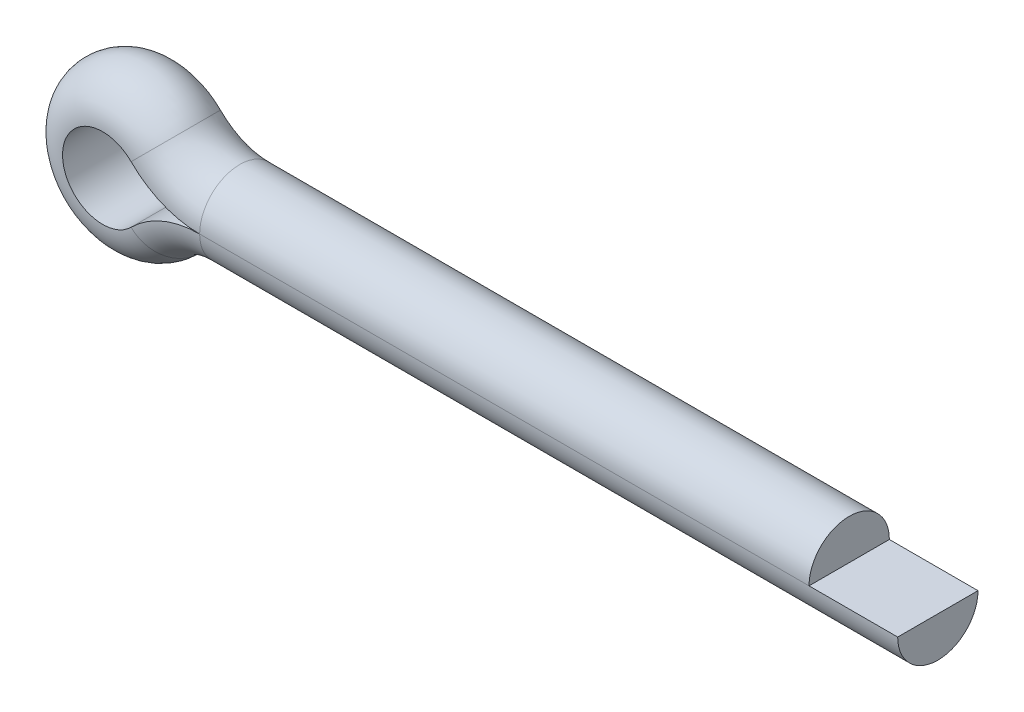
ISO-10303-21;
HEADER;
FILE_DESCRIPTION(('STEP AP214'),'2;1');
FILE_NAME('part.step','',(''),(''),'','','');
FILE_SCHEMA(('AUTOMOTIVE_DESIGN { 1 0 10303 214 1 1 1 1 }'));
ENDSEC;
DATA;
#1=APPLICATION_CONTEXT('core data for automotive mechanical design processes');
#2=APPLICATION_PROTOCOL_DEFINITION('international standard','automotive_design',2000,#1);
#3=PRODUCT_CONTEXT('',#1,'mechanical');
#4=PRODUCT('Part','Part','',(#3));
#5=PRODUCT_RELATED_PRODUCT_CATEGORY('part','',(#4));
#6=PRODUCT_DEFINITION_FORMATION('','',#4);
#7=PRODUCT_DEFINITION_CONTEXT('part definition',#1,'design');
#8=PRODUCT_DEFINITION('design','',#6,#7);
#9=PRODUCT_DEFINITION_SHAPE('','',#8);
#10=(LENGTH_UNIT() NAMED_UNIT(*) SI_UNIT(.MILLI.,.METRE.));
#11=(NAMED_UNIT(*) PLANE_ANGLE_UNIT() SI_UNIT($,.RADIAN.));
#12=(NAMED_UNIT(*) SI_UNIT($,.STERADIAN.) SOLID_ANGLE_UNIT());
#13=UNCERTAINTY_MEASURE_WITH_UNIT(LENGTH_MEASURE(1.E-05),#10,'distance_accuracy_value','');
#14=(GEOMETRIC_REPRESENTATION_CONTEXT(3) GLOBAL_UNCERTAINTY_ASSIGNED_CONTEXT((#13)) GLOBAL_UNIT_ASSIGNED_CONTEXT((#10,
#11,#12)) REPRESENTATION_CONTEXT('',''));
#15=CARTESIAN_POINT('',(0.,0.,0.));
#16=DIRECTION('',(0.,0.,1.));
#17=DIRECTION('',(1.,0.,0.));
#18=AXIS2_PLACEMENT_3D('',#15,#16,#17);
#19=CARTESIAN_POINT('',(6.40000000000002,0.,-1.45));
#20=DIRECTION('',(0.,-1.,0.));
#21=DIRECTION('',(1.,0.,0.));
#22=AXIS2_PLACEMENT_3D('',#19,#20,#21);
#23=PLANE('',#22);
#24=DIRECTION('',(0.,0.,-1.));
#25=VECTOR('',#24,1.);
#26=CARTESIAN_POINT('',(6.40000000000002,0.,-1.45));
#27=LINE('',#26,#25);
#28=CARTESIAN_POINT('',(6.40000000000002,0.,1.45));
#29=VERTEX_POINT('',#28);
#30=CARTESIAN_POINT('',(6.40000000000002,0.,-1.45));
#31=VERTEX_POINT('',#30);
#32=EDGE_CURVE('E137',#29,#31,#27,.T.);
#33=ORIENTED_EDGE('',*,*,#32,.F.);
#34=DIRECTION('',(1.,0.,0.));
#35=VECTOR('',#34,1.);
#36=CARTESIAN_POINT('',(6.40000000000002,0.,1.45));
#37=LINE('',#36,#35);
#38=CARTESIAN_POINT('',(31.6,0.,1.45));
#39=VERTEX_POINT('',#38);
#40=EDGE_CURVE('E37',#29,#39,#37,.T.);
#41=ORIENTED_EDGE('',*,*,#40,.T.);
#42=DIRECTION('',(0.,0.,-1.));
#43=VECTOR('',#42,1.);
#44=CARTESIAN_POINT('',(31.6,0.,-1.45));
#45=LINE('',#44,#43);
#46=CARTESIAN_POINT('',(31.6,0.,-1.45));
#47=VERTEX_POINT('',#46);
#48=EDGE_CURVE('E44',#39,#47,#45,.T.);
#49=ORIENTED_EDGE('',*,*,#48,.T.);
#50=DIRECTION('',(1.,0.,0.));
#51=VECTOR('',#50,1.);
#52=CARTESIAN_POINT('',(6.40000000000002,0.,-1.45));
#53=LINE('',#52,#51);
#54=EDGE_CURVE('E11',#31,#47,#53,.T.);
#55=ORIENTED_EDGE('',*,*,#54,.F.);
#56=EDGE_LOOP('',(#33,#41,#49,#55));
#57=FACE_BOUND('',#56,.T.);
#58=ADVANCED_FACE('F30',(#57),#23,.F.);
#59=CARTESIAN_POINT('',(6.40000000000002,0.,0.));
#60=DIRECTION('',(1.,0.,0.));
#61=DIRECTION('',(0.,1.,0.));
#62=AXIS2_PLACEMENT_3D('',#59,#60,#61);
#63=CYLINDRICAL_SURFACE('',#62,1.45);
#64=CARTESIAN_POINT('',(6.40000000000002,0.,0.));
#65=DIRECTION('',(-1.,0.,0.));
#66=DIRECTION('',(0.,0.,-1.));
#67=AXIS2_PLACEMENT_3D('',#64,#65,#66);
#68=CIRCLE('',#67,1.45);
#69=EDGE_CURVE('E134',#31,#29,#68,.T.);
#70=ORIENTED_EDGE('',*,*,#69,.F.);
#71=ORIENTED_EDGE('',*,*,#54,.T.);
#72=CARTESIAN_POINT('',(31.6,0.,0.));
#73=DIRECTION('',(-1.,0.,0.));
#74=DIRECTION('',(0.,0.,-1.));
#75=AXIS2_PLACEMENT_3D('',#72,#73,#74);
#76=CIRCLE('',#75,1.45);
#77=EDGE_CURVE('E50',#47,#39,#76,.T.);
#78=ORIENTED_EDGE('',*,*,#77,.T.);
#79=ORIENTED_EDGE('',*,*,#40,.F.);
#80=EDGE_LOOP('',(#70,#71,#78,#79));
#81=FACE_BOUND('',#80,.T.);
#82=ADVANCED_FACE('F149',(#81),#63,.T.);
#83=CARTESIAN_POINT('',(6.4,-3.49913793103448,0.));
#84=DIRECTION('',(0.,0.,-1.));
#85=DIRECTION('',(-1.,0.,0.));
#86=AXIS2_PLACEMENT_3D('',#83,#84,#85);
#87=CYLINDRICAL_SURFACE('',#86,3.49913793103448);
#88=DIRECTION('',(0.,0.,-1.));
#89=VECTOR('',#88,1.);
#90=CARTESIAN_POINT('',(3.92543110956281,-1.02517854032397,-1.45));
#91=LINE('',#90,#89);
#92=CARTESIAN_POINT('',(3.92543110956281,-1.02517854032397,1.45));
#93=VERTEX_POINT('',#92);
#94=CARTESIAN_POINT('',(3.92543110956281,-1.02517854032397,-1.45));
#95=VERTEX_POINT('',#94);
#96=EDGE_CURVE('E125',#93,#95,#91,.T.);
#97=ORIENTED_EDGE('',*,*,#96,.F.);
#98=CARTESIAN_POINT('',(6.4,-3.49913793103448,1.45));
#99=DIRECTION('',(0.,0.,-1.));
#100=DIRECTION('',(-1.,0.,0.));
#101=AXIS2_PLACEMENT_3D('',#98,#99,#100);
#102=CIRCLE('',#101,3.49913793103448);
#103=EDGE_CURVE('E140',#93,#29,#102,.T.);
#104=ORIENTED_EDGE('',*,*,#103,.T.);
#105=ORIENTED_EDGE('',*,*,#32,.T.);
#106=CARTESIAN_POINT('',(6.4,-3.49913793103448,-1.45));
#107=DIRECTION('',(0.,0.,-1.));
#108=DIRECTION('',(-1.,0.,0.));
#109=AXIS2_PLACEMENT_3D('',#106,#107,#108);
#110=CIRCLE('',#109,3.49913793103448);
#111=EDGE_CURVE('E143',#95,#31,#110,.T.);
#112=ORIENTED_EDGE('',*,*,#111,.F.);
#113=EDGE_LOOP('',(#97,#104,#105,#112));
#114=FACE_BOUND('',#113,.T.);
#115=ADVANCED_FACE('F153',(#114),#87,.T.);
#116=CARTESIAN_POINT('',(6.4,-3.49913793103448,0.));
#117=DIRECTION('',(0.,0.,-1.));
#118=DIRECTION('',(-1.,0.,0.));
#119=AXIS2_PLACEMENT_3D('',#116,#117,#118);
#120=TOROIDAL_SURFACE('',#119,3.49913793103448,1.45);
#121=CARTESIAN_POINT('',(3.92543110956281,-1.02517854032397,0.));
#122=DIRECTION('',(-0.707019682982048,-0.707193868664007,0.));
#123=DIRECTION('',(0.,0.,-1.));
#124=AXIS2_PLACEMENT_3D('',#121,#122,#123);
#125=CIRCLE('',#124,1.45);
#126=EDGE_CURVE('E122',#95,#93,#125,.T.);
#127=ORIENTED_EDGE('',*,*,#126,.F.);
#128=ORIENTED_EDGE('',*,*,#111,.T.);
#129=ORIENTED_EDGE('',*,*,#69,.T.);
#130=ORIENTED_EDGE('',*,*,#103,.F.);
#131=EDGE_LOOP('',(#127,#128,#129,#130));
#132=FACE_BOUND('',#131,.T.);
#133=ADVANCED_FACE('F155',(#132),#120,.T.);
#134=CARTESIAN_POINT('',(2.9,0.,0.));
#135=DIRECTION('',(0.,0.,1.));
#136=DIRECTION('',(1.,0.,0.));
#137=AXIS2_PLACEMENT_3D('',#134,#135,#136);
#138=CYLINDRICAL_SURFACE('',#137,1.45);
#139=DIRECTION('',(0.,0.,-1.));
#140=VECTOR('',#139,1.);
#141=CARTESIAN_POINT('',(3.9254311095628,1.02517854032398,-1.45));
#142=LINE('',#141,#140);
#143=CARTESIAN_POINT('',(3.9254311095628,1.02517854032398,1.45));
#144=VERTEX_POINT('',#143);
#145=CARTESIAN_POINT('',(3.9254311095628,1.02517854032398,-1.45));
#146=VERTEX_POINT('',#145);
#147=EDGE_CURVE('E94',#144,#146,#142,.T.);
#148=ORIENTED_EDGE('',*,*,#147,.F.);
#149=CARTESIAN_POINT('',(2.9,0.,1.45));
#150=DIRECTION('',(0.,0.,1.));
#151=DIRECTION('',(1.,0.,0.));
#152=AXIS2_PLACEMENT_3D('',#149,#150,#151);
#153=CIRCLE('',#152,1.45);
#154=EDGE_CURVE('E128',#144,#93,#153,.T.);
#155=ORIENTED_EDGE('',*,*,#154,.T.);
#156=ORIENTED_EDGE('',*,*,#96,.T.);
#157=CARTESIAN_POINT('',(2.9,0.,-1.45));
#158=DIRECTION('',(0.,0.,1.));
#159=DIRECTION('',(1.,0.,0.));
#160=AXIS2_PLACEMENT_3D('',#157,#158,#159);
#161=CIRCLE('',#160,1.45);
#162=EDGE_CURVE('E131',#146,#95,#161,.T.);
#163=ORIENTED_EDGE('',*,*,#162,.F.);
#164=EDGE_LOOP('',(#148,#155,#156,#163));
#165=FACE_BOUND('',#164,.T.);
#166=ADVANCED_FACE('F159',(#165),#138,.F.);
#167=CARTESIAN_POINT('',(2.9,0.,0.));
#168=DIRECTION('',(0.,0.,1.));
#169=DIRECTION('',(1.,0.,0.));
#170=AXIS2_PLACEMENT_3D('',#167,#168,#169);
#171=TOROIDAL_SURFACE('',#170,1.45,1.45);
#172=CARTESIAN_POINT('',(3.9254311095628,1.02517854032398,0.));
#173=DIRECTION('',(0.70701968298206,-0.707193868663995,0.));
#174=DIRECTION('',(0.,0.,-1.));
#175=AXIS2_PLACEMENT_3D('',#172,#173,#174);
#176=CIRCLE('',#175,1.45);
#177=EDGE_CURVE('E90',#146,#144,#176,.T.);
#178=ORIENTED_EDGE('',*,*,#177,.F.);
#179=ORIENTED_EDGE('',*,*,#162,.T.);
#180=ORIENTED_EDGE('',*,*,#126,.T.);
#181=ORIENTED_EDGE('',*,*,#154,.F.);
#182=EDGE_LOOP('',(#178,#179,#180,#181));
#183=FACE_BOUND('',#182,.T.);
#184=ADVANCED_FACE('F160',(#183),#171,.T.);
#185=CARTESIAN_POINT('',(6.4,3.49913793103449,0.));
#186=DIRECTION('',(0.,0.,-1.));
#187=DIRECTION('',(-1.,0.,0.));
#188=AXIS2_PLACEMENT_3D('',#185,#186,#187);
#189=CYLINDRICAL_SURFACE('',#188,3.49913793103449);
#190=DIRECTION('',(0.,0.,-1.));
#191=VECTOR('',#190,1.);
#192=CARTESIAN_POINT('',(6.4,0.,-1.45));
#193=LINE('',#192,#191);
#194=CARTESIAN_POINT('',(6.4,0.,1.45));
#195=VERTEX_POINT('',#194);
#196=CARTESIAN_POINT('',(6.4,0.,-1.45));
#197=VERTEX_POINT('',#196);
#198=EDGE_CURVE('E97',#195,#197,#193,.T.);
#199=ORIENTED_EDGE('',*,*,#198,.F.);
#200=CARTESIAN_POINT('',(6.4,3.49913793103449,1.45));
#201=DIRECTION('',(0.,0.,-1.));
#202=DIRECTION('',(-1.,0.,0.));
#203=AXIS2_PLACEMENT_3D('',#200,#201,#202);
#204=CIRCLE('',#203,3.49913793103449);
#205=EDGE_CURVE('E82',#195,#144,#204,.T.);
#206=ORIENTED_EDGE('',*,*,#205,.T.);
#207=ORIENTED_EDGE('',*,*,#147,.T.);
#208=CARTESIAN_POINT('',(6.4,3.49913793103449,-1.45));
#209=DIRECTION('',(0.,0.,-1.));
#210=DIRECTION('',(-1.,0.,0.));
#211=AXIS2_PLACEMENT_3D('',#208,#209,#210);
#212=CIRCLE('',#211,3.49913793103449);
#213=EDGE_CURVE('E93',#197,#146,#212,.T.);
#214=ORIENTED_EDGE('',*,*,#213,.F.);
#215=EDGE_LOOP('',(#199,#206,#207,#214));
#216=FACE_BOUND('',#215,.T.);
#217=ADVANCED_FACE('F99',(#216),#189,.T.);
#218=CARTESIAN_POINT('',(6.4,3.49913793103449,0.));
#219=DIRECTION('',(0.,0.,-1.));
#220=DIRECTION('',(-1.,0.,0.));
#221=AXIS2_PLACEMENT_3D('',#218,#219,#220);
#222=TOROIDAL_SURFACE('',#221,3.49913793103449,1.45);
#223=CARTESIAN_POINT('',(6.4,0.,0.));
#224=DIRECTION('',(1.,0.,0.));
#225=DIRECTION('',(0.,0.,-1.));
#226=AXIS2_PLACEMENT_3D('',#223,#224,#225);
#227=CIRCLE('',#226,1.45);
#228=EDGE_CURVE('E87',#197,#195,#227,.T.);
#229=ORIENTED_EDGE('',*,*,#228,.F.);
#230=ORIENTED_EDGE('',*,*,#213,.T.);
#231=ORIENTED_EDGE('',*,*,#177,.T.);
#232=ORIENTED_EDGE('',*,*,#205,.F.);
#233=EDGE_LOOP('',(#229,#230,#231,#232));
#234=FACE_BOUND('',#233,.T.);
#235=ADVANCED_FACE('F84',(#234),#222,.T.);
#236=CARTESIAN_POINT('',(6.4,0.,0.));
#237=DIRECTION('',(1.,0.,0.));
#238=DIRECTION('',(0.,0.,-1.));
#239=AXIS2_PLACEMENT_3D('',#236,#237,#238);
#240=CYLINDRICAL_SURFACE('',#239,1.45);
#241=CARTESIAN_POINT('',(28.4,0.,0.));
#242=DIRECTION('',(1.,0.,0.));
#243=DIRECTION('',(0.,0.,-1.));
#244=AXIS2_PLACEMENT_3D('',#241,#242,#243);
#245=CIRCLE('',#244,1.45);
#246=CARTESIAN_POINT('',(28.4,0.,-1.45));
#247=VERTEX_POINT('',#246);
#248=CARTESIAN_POINT('',(28.4,0.,1.45));
#249=VERTEX_POINT('',#248);
#250=EDGE_CURVE('E114',#247,#249,#245,.T.);
#251=ORIENTED_EDGE('',*,*,#250,.F.);
#252=DIRECTION('',(1.,0.,0.));
#253=VECTOR('',#252,1.);
#254=CARTESIAN_POINT('',(6.4,0.,-1.45));
#255=LINE('',#254,#253);
#256=EDGE_CURVE('E110',#197,#247,#255,.T.);
#257=ORIENTED_EDGE('',*,*,#256,.F.);
#258=ORIENTED_EDGE('',*,*,#228,.T.);
#259=DIRECTION('',(1.,0.,0.));
#260=VECTOR('',#259,1.);
#261=CARTESIAN_POINT('',(6.4,0.,1.45));
#262=LINE('',#261,#260);
#263=EDGE_CURVE('E101',#195,#249,#262,.T.);
#264=ORIENTED_EDGE('',*,*,#263,.T.);
#265=EDGE_LOOP('',(#251,#257,#258,#264));
#266=FACE_BOUND('',#265,.T.);
#267=ADVANCED_FACE('F112',(#266),#240,.T.);
#268=CARTESIAN_POINT('',(6.4,0.,-1.45));
#269=DIRECTION('',(0.,-1.,0.));
#270=DIRECTION('',(0.,0.,-1.));
#271=AXIS2_PLACEMENT_3D('',#268,#269,#270);
#272=PLANE('',#271);
#273=DIRECTION('',(0.,0.,-1.));
#274=VECTOR('',#273,1.);
#275=CARTESIAN_POINT('',(28.4,0.,-1.45));
#276=LINE('',#275,#274);
#277=EDGE_CURVE('E106',#249,#247,#276,.T.);
#278=ORIENTED_EDGE('',*,*,#277,.F.);
#279=ORIENTED_EDGE('',*,*,#263,.F.);
#280=ORIENTED_EDGE('',*,*,#198,.T.);
#281=ORIENTED_EDGE('',*,*,#256,.T.);
#282=EDGE_LOOP('',(#278,#279,#280,#281));
#283=FACE_BOUND('',#282,.T.);
#284=ADVANCED_FACE('F104',(#283),#272,.T.);
#285=CARTESIAN_POINT('',(31.6,0.,0.));
#286=DIRECTION('',(-1.,0.,0.));
#287=DIRECTION('',(0.,0.,-1.));
#288=AXIS2_PLACEMENT_3D('',#285,#286,#287);
#289=PLANE('',#288);
#290=ORIENTED_EDGE('',*,*,#77,.F.);
#291=ORIENTED_EDGE('',*,*,#48,.F.);
#292=EDGE_LOOP('',(#290,#291));
#293=FACE_BOUND('',#292,.T.);
#294=ADVANCED_FACE('F222',(#293),#289,.F.);
#295=CARTESIAN_POINT('',(28.4,0.,0.));
#296=DIRECTION('',(1.,0.,0.));
#297=DIRECTION('',(0.,0.,-1.));
#298=AXIS2_PLACEMENT_3D('',#295,#296,#297);
#299=PLANE('',#298);
#300=ORIENTED_EDGE('',*,*,#250,.T.);
#301=ORIENTED_EDGE('',*,*,#277,.T.);
#302=EDGE_LOOP('',(#300,#301));
#303=FACE_BOUND('',#302,.T.);
#304=ADVANCED_FACE('F231',(#303),#299,.T.);
#305=CLOSED_SHELL('',(#58,#82,#115,#133,#166,#184,#217,#235,#267,#284,#294,#304));
#306=MANIFOLD_SOLID_BREP('B2',#305);
#307=ADVANCED_BREP_SHAPE_REPRESENTATION('',(#18,#306),#14);
#308=SHAPE_DEFINITION_REPRESENTATION(#9,#307);
ENDSEC;
END-ISO-10303-21;
